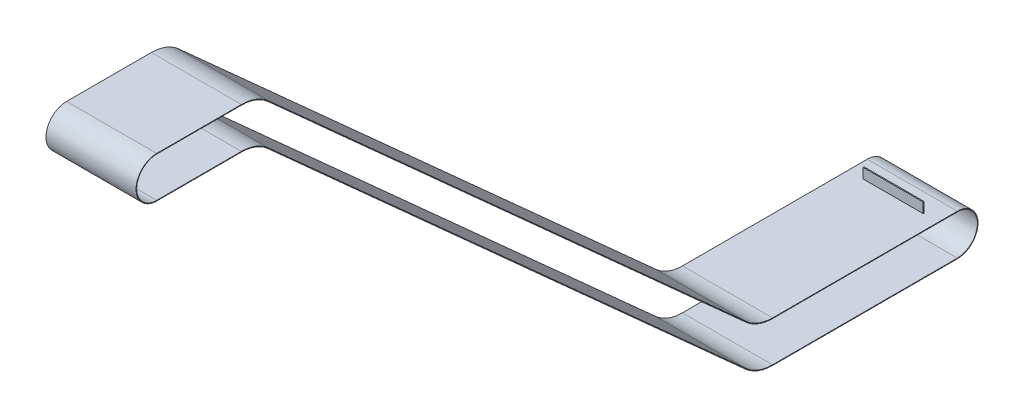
ISO-10303-21;
HEADER;
FILE_DESCRIPTION(('STEP AP214'),'2;1');
FILE_NAME('part.step','',(''),(''),'','','');
FILE_SCHEMA(('AUTOMOTIVE_DESIGN { 1 0 10303 214 1 1 1 1 }'));
ENDSEC;
DATA;
#1=APPLICATION_CONTEXT('core data for automotive mechanical design processes');
#2=APPLICATION_PROTOCOL_DEFINITION('international standard','automotive_design',2000,#1);
#3=PRODUCT_CONTEXT('',#1,'mechanical');
#4=PRODUCT('Part','Part','',(#3));
#5=PRODUCT_RELATED_PRODUCT_CATEGORY('part','',(#4));
#6=PRODUCT_DEFINITION_FORMATION('','',#4);
#7=PRODUCT_DEFINITION_CONTEXT('part definition',#1,'design');
#8=PRODUCT_DEFINITION('design','',#6,#7);
#9=PRODUCT_DEFINITION_SHAPE('','',#8);
#10=(LENGTH_UNIT() NAMED_UNIT(*) SI_UNIT(.MILLI.,.METRE.));
#11=(NAMED_UNIT(*) PLANE_ANGLE_UNIT() SI_UNIT($,.RADIAN.));
#12=(NAMED_UNIT(*) SI_UNIT($,.STERADIAN.) SOLID_ANGLE_UNIT());
#13=UNCERTAINTY_MEASURE_WITH_UNIT(LENGTH_MEASURE(1.E-05),#10,'distance_accuracy_value','');
#14=(GEOMETRIC_REPRESENTATION_CONTEXT(3) GLOBAL_UNCERTAINTY_ASSIGNED_CONTEXT((#13)) GLOBAL_UNIT_ASSIGNED_CONTEXT((#10,
#11,#12)) REPRESENTATION_CONTEXT('',''));
#15=CARTESIAN_POINT('',(0.,0.,0.));
#16=DIRECTION('',(0.,0.,1.));
#17=DIRECTION('',(1.,0.,0.));
#18=AXIS2_PLACEMENT_3D('',#15,#16,#17);
#19=CARTESIAN_POINT('',(450.,-2244.,-4000.));
#20=DIRECTION('',(0.,-1.,0.));
#21=DIRECTION('',(0.,0.,-1.));
#22=AXIS2_PLACEMENT_3D('',#19,#20,#21);
#23=PLANE('',#22);
#24=DIRECTION('',(0.,0.,1.));
#25=VECTOR('',#24,1.);
#26=CARTESIAN_POINT('',(-450.,-2244.,-4000.));
#27=LINE('',#26,#25);
#28=CARTESIAN_POINT('',(-450.,-2244.,-4000.));
#29=VERTEX_POINT('',#28);
#30=CARTESIAN_POINT('',(-450.,-2244.,-2153.49440209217));
#31=VERTEX_POINT('',#30);
#32=EDGE_CURVE('E511',#29,#31,#27,.T.);
#33=ORIENTED_EDGE('',*,*,#32,.T.);
#34=DIRECTION('',(-1.,0.,0.));
#35=VECTOR('',#34,1.);
#36=CARTESIAN_POINT('',(450.,-2244.,-2153.49440209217));
#37=LINE('',#36,#35);
#38=CARTESIAN_POINT('',(450.,-2244.,-2153.49440209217));
#39=VERTEX_POINT('',#38);
#40=EDGE_CURVE('E540',#39,#31,#37,.T.);
#41=ORIENTED_EDGE('',*,*,#40,.F.);
#42=DIRECTION('',(0.,0.,1.));
#43=VECTOR('',#42,1.);
#44=CARTESIAN_POINT('',(450.,-2244.,-4000.));
#45=LINE('',#44,#43);
#46=CARTESIAN_POINT('',(450.,-2244.,-4000.));
#47=VERTEX_POINT('',#46);
#48=EDGE_CURVE('E474',#47,#39,#45,.T.);
#49=ORIENTED_EDGE('',*,*,#48,.F.);
#50=DIRECTION('',(-1.,0.,0.));
#51=VECTOR('',#50,1.);
#52=CARTESIAN_POINT('',(450.,-2244.,-4000.));
#53=LINE('',#52,#51);
#54=EDGE_CURVE('E544',#47,#29,#53,.T.);
#55=ORIENTED_EDGE('',*,*,#54,.T.);
#56=EDGE_LOOP('',(#33,#41,#49,#55));
#57=FACE_BOUND('',#56,.T.);
#58=DIRECTION('',(0.,0.,-1.));
#59=VECTOR('',#58,1.);
#60=CARTESIAN_POINT('',(300.,-2244.,-3818.00458239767));
#61=LINE('',#60,#59);
#62=CARTESIAN_POINT('',(300.,-2244.,-3808.00458239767));
#63=VERTEX_POINT('',#62);
#64=CARTESIAN_POINT('',(300.,-2244.,-3818.00458239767));
#65=VERTEX_POINT('',#64);
#66=EDGE_CURVE('E319',#63,#65,#61,.T.);
#67=ORIENTED_EDGE('',*,*,#66,.F.);
#68=DIRECTION('',(1.,0.,0.));
#69=VECTOR('',#68,1.);
#70=CARTESIAN_POINT('',(-300.,-2244.,-3808.00458239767));
#71=LINE('',#70,#69);
#72=CARTESIAN_POINT('',(-300.,-2244.,-3808.00458239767));
#73=VERTEX_POINT('',#72);
#74=EDGE_CURVE('E316',#73,#63,#71,.T.);
#75=ORIENTED_EDGE('',*,*,#74,.F.);
#76=DIRECTION('',(0.,0.,1.));
#77=VECTOR('',#76,1.);
#78=CARTESIAN_POINT('',(-300.,-2244.,-3818.00458239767));
#79=LINE('',#78,#77);
#80=CARTESIAN_POINT('',(-300.,-2244.,-3818.00458239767));
#81=VERTEX_POINT('',#80);
#82=EDGE_CURVE('E132',#81,#73,#79,.T.);
#83=ORIENTED_EDGE('',*,*,#82,.F.);
#84=DIRECTION('',(-1.,0.,0.));
#85=VECTOR('',#84,1.);
#86=CARTESIAN_POINT('',(-300.,-2244.,-3818.00458239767));
#87=LINE('',#86,#85);
#88=EDGE_CURVE('E127',#65,#81,#87,.T.);
#89=ORIENTED_EDGE('',*,*,#88,.F.);
#90=EDGE_LOOP('',(#67,#75,#83,#89));
#91=FACE_BOUND('',#90,.T.);
#92=ADVANCED_FACE('F111',(#57,#91),#23,.F.);
#93=CARTESIAN_POINT('',(450.,2050.,4000.));
#94=DIRECTION('',(1.,0.,0.));
#95=DIRECTION('',(0.,0.,-1.));
#96=AXIS2_PLACEMENT_3D('',#93,#94,#95);
#97=PLANE('',#96);
#98=CARTESIAN_POINT('',(450.,2050.,4000.));
#99=DIRECTION('',(1.,0.,0.));
#100=DIRECTION('',(0.,0.,-1.));
#101=AXIS2_PLACEMENT_3D('',#98,#99,#100);
#102=CIRCLE('',#101,206.);
#103=CARTESIAN_POINT('',(450.,2256.,4000.));
#104=VERTEX_POINT('',#103);
#105=CARTESIAN_POINT('',(450.,1844.,4000.));
#106=VERTEX_POINT('',#105);
#107=EDGE_CURVE('E451',#104,#106,#102,.T.);
#108=ORIENTED_EDGE('',*,*,#107,.T.);
#109=DIRECTION('',(0.,0.,-1.));
#110=VECTOR('',#109,1.);
#111=CARTESIAN_POINT('',(450.,1844.,4000.));
#112=LINE('',#111,#110);
#113=CARTESIAN_POINT('',(450.,1844.,3153.49440209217));
#114=VERTEX_POINT('',#113);
#115=EDGE_CURVE('E455',#106,#114,#112,.T.);
#116=ORIENTED_EDGE('',*,*,#115,.T.);
#117=CARTESIAN_POINT('',(450.,1450.,3153.49440209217));
#118=DIRECTION('',(1.,0.,0.));
#119=DIRECTION('',(0.,0.,-1.));
#120=AXIS2_PLACEMENT_3D('',#117,#118,#119);
#121=CIRCLE('',#120,394.);
#122=CARTESIAN_POINT('',(450.,1742.85789362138,2889.92229783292));
#123=VERTEX_POINT('',#122);
#124=EDGE_CURVE('E459',#114,#123,#121,.F.);
#125=ORIENTED_EDGE('',*,*,#124,.T.);
#126=DIRECTION('',(0.,-0.66896473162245,-0.743294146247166));
#127=VECTOR('',#126,1.);
#128=CARTESIAN_POINT('',(450.,-2551.77742337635,-1881.89472105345));
#129=LINE('',#128,#127);
#130=CARTESIAN_POINT('',(450.,-2551.77742337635,-1881.89472105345));
#131=VERTEX_POINT('',#130);
#132=EDGE_CURVE('E462',#123,#131,#129,.T.);
#133=ORIENTED_EDGE('',*,*,#132,.T.);
#134=CARTESIAN_POINT('',(450.,-2250.,-2153.49440209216));
#135=DIRECTION('',(1.,0.,0.));
#136=DIRECTION('',(0.,0.,-1.));
#137=AXIS2_PLACEMENT_3D('',#134,#135,#136);
#138=CIRCLE('',#137,406.);
#139=CARTESIAN_POINT('',(450.,-2656.,-2153.49440209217));
#140=VERTEX_POINT('',#139);
#141=EDGE_CURVE('E465',#131,#140,#138,.T.);
#142=ORIENTED_EDGE('',*,*,#141,.T.);
#143=DIRECTION('',(0.,0.,-1.));
#144=VECTOR('',#143,1.);
#145=CARTESIAN_POINT('',(450.,-2656.,-4000.));
#146=LINE('',#145,#144);
#147=CARTESIAN_POINT('',(450.,-2656.,-4000.));
#148=VERTEX_POINT('',#147);
#149=EDGE_CURVE('E468',#140,#148,#146,.T.);
#150=ORIENTED_EDGE('',*,*,#149,.T.);
#151=CARTESIAN_POINT('',(450.,-2450.,-4000.));
#152=DIRECTION('',(1.,0.,0.));
#153=DIRECTION('',(0.,0.,-1.));
#154=AXIS2_PLACEMENT_3D('',#151,#152,#153);
#155=CIRCLE('',#154,206.);
#156=EDGE_CURVE('E471',#148,#47,#155,.T.);
#157=ORIENTED_EDGE('',*,*,#156,.T.);
#158=ORIENTED_EDGE('',*,*,#48,.T.);
#159=CARTESIAN_POINT('',(450.,-1850.,-2153.49440209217));
#160=DIRECTION('',(1.,0.,0.));
#161=DIRECTION('',(0.,0.,-1.));
#162=AXIS2_PLACEMENT_3D('',#159,#160,#161);
#163=CIRCLE('',#162,394.);
#164=CARTESIAN_POINT('',(450.,-2142.85789362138,-1889.92229783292));
#165=VERTEX_POINT('',#164);
#166=EDGE_CURVE('E477',#39,#165,#163,.F.);
#167=ORIENTED_EDGE('',*,*,#166,.T.);
#168=DIRECTION('',(0.,0.66896473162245,0.743294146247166));
#169=VECTOR('',#168,1.);
#170=CARTESIAN_POINT('',(450.,2151.77742337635,2881.89472105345));
#171=LINE('',#170,#169);
#172=CARTESIAN_POINT('',(450.,2151.77742337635,2881.89472105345));
#173=VERTEX_POINT('',#172);
#174=EDGE_CURVE('E480',#165,#173,#171,.T.);
#175=ORIENTED_EDGE('',*,*,#174,.T.);
#176=CARTESIAN_POINT('',(450.,1850.,3153.49440209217));
#177=DIRECTION('',(1.,0.,0.));
#178=DIRECTION('',(0.,0.,-1.));
#179=AXIS2_PLACEMENT_3D('',#176,#177,#178);
#180=CIRCLE('',#179,406.);
#181=CARTESIAN_POINT('',(450.,2256.,3153.49440209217));
#182=VERTEX_POINT('',#181);
#183=EDGE_CURVE('E483',#173,#182,#180,.T.);
#184=ORIENTED_EDGE('',*,*,#183,.T.);
#185=DIRECTION('',(0.,0.,1.));
#186=VECTOR('',#185,1.);
#187=CARTESIAN_POINT('',(450.,2256.,3153.49440209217));
#188=LINE('',#187,#186);
#189=EDGE_CURVE('E486',#182,#104,#188,.T.);
#190=ORIENTED_EDGE('',*,*,#189,.T.);
#191=EDGE_LOOP('',(#108,#116,#125,#133,#142,#150,#157,#158,#167,#175,#184,#190));
#192=FACE_BOUND('',#191,.T.);
#193=DIRECTION('',(0.,0.,-1.));
#194=VECTOR('',#193,1.);
#195=CARTESIAN_POINT('',(450.,1850.,4000.));
#196=LINE('',#195,#194);
#197=CARTESIAN_POINT('',(450.,1850.,4000.));
#198=VERTEX_POINT('',#197);
#199=CARTESIAN_POINT('',(450.,1850.,3153.49440209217));
#200=VERTEX_POINT('',#199);
#201=EDGE_CURVE('E335',#198,#200,#196,.T.);
#202=ORIENTED_EDGE('',*,*,#201,.F.);
#203=CARTESIAN_POINT('',(450.,2050.,4000.));
#204=DIRECTION('',(1.,0.,0.));
#205=DIRECTION('',(0.,0.,-1.));
#206=AXIS2_PLACEMENT_3D('',#203,#204,#205);
#207=CIRCLE('',#206,200.);
#208=CARTESIAN_POINT('',(450.,2250.,4000.));
#209=VERTEX_POINT('',#208);
#210=EDGE_CURVE('E332',#209,#198,#207,.T.);
#211=ORIENTED_EDGE('',*,*,#210,.F.);
#212=DIRECTION('',(0.,0.,1.));
#213=VECTOR('',#212,1.);
#214=CARTESIAN_POINT('',(450.,2250.,3153.49440209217));
#215=LINE('',#214,#213);
#216=CARTESIAN_POINT('',(450.,2250.,3153.49440209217));
#217=VERTEX_POINT('',#216);
#218=EDGE_CURVE('E367',#217,#209,#215,.T.);
#219=ORIENTED_EDGE('',*,*,#218,.F.);
#220=CARTESIAN_POINT('',(450.,1850.,3153.49440209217));
#221=DIRECTION('',(1.,0.,0.));
#222=DIRECTION('',(0.,0.,-1.));
#223=AXIS2_PLACEMENT_3D('',#220,#221,#222);
#224=CIRCLE('',#223,400.);
#225=CARTESIAN_POINT('',(450.,2147.31765849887,2885.90850944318));
#226=VERTEX_POINT('',#225);
#227=EDGE_CURVE('E363',#226,#217,#224,.T.);
#228=ORIENTED_EDGE('',*,*,#227,.F.);
#229=DIRECTION('',(0.,0.66896473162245,0.743294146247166));
#230=VECTOR('',#229,1.);
#231=CARTESIAN_POINT('',(450.,2147.31765849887,2885.90850944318));
#232=LINE('',#231,#230);
#233=CARTESIAN_POINT('',(450.,-2147.31765849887,-1885.90850944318));
#234=VERTEX_POINT('',#233);
#235=EDGE_CURVE('E360',#234,#226,#232,.T.);
#236=ORIENTED_EDGE('',*,*,#235,.F.);
#237=CARTESIAN_POINT('',(450.,-1850.,-2153.49440209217));
#238=DIRECTION('',(-1.,0.,0.));
#239=DIRECTION('',(0.,0.,-1.));
#240=AXIS2_PLACEMENT_3D('',#237,#238,#239);
#241=CIRCLE('',#240,400.);
#242=CARTESIAN_POINT('',(450.,-2250.,-2153.49440209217));
#243=VERTEX_POINT('',#242);
#244=EDGE_CURVE('E357',#243,#234,#241,.T.);
#245=ORIENTED_EDGE('',*,*,#244,.F.);
#246=DIRECTION('',(0.,0.,1.));
#247=VECTOR('',#246,1.);
#248=CARTESIAN_POINT('',(450.,-2250.,-4000.));
#249=LINE('',#248,#247);
#250=CARTESIAN_POINT('',(450.,-2250.,-4000.));
#251=VERTEX_POINT('',#250);
#252=EDGE_CURVE('E354',#251,#243,#249,.T.);
#253=ORIENTED_EDGE('',*,*,#252,.F.);
#254=CARTESIAN_POINT('',(450.,-2450.,-4000.));
#255=DIRECTION('',(1.,0.,0.));
#256=DIRECTION('',(0.,0.,-1.));
#257=AXIS2_PLACEMENT_3D('',#254,#255,#256);
#258=CIRCLE('',#257,200.);
#259=CARTESIAN_POINT('',(450.,-2650.,-4000.));
#260=VERTEX_POINT('',#259);
#261=EDGE_CURVE('E351',#260,#251,#258,.T.);
#262=ORIENTED_EDGE('',*,*,#261,.F.);
#263=DIRECTION('',(0.,0.,-1.));
#264=VECTOR('',#263,1.);
#265=CARTESIAN_POINT('',(450.,-2650.,-4000.));
#266=LINE('',#265,#264);
#267=CARTESIAN_POINT('',(450.,-2650.,-2153.49440209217));
#268=VERTEX_POINT('',#267);
#269=EDGE_CURVE('E348',#268,#260,#266,.T.);
#270=ORIENTED_EDGE('',*,*,#269,.F.);
#271=CARTESIAN_POINT('',(450.,-2250.,-2153.49440209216));
#272=DIRECTION('',(1.,0.,0.));
#273=DIRECTION('',(0.,0.,-1.));
#274=AXIS2_PLACEMENT_3D('',#271,#272,#273);
#275=CIRCLE('',#274,400.);
#276=CARTESIAN_POINT('',(450.,-2547.31765849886,-1885.90850944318));
#277=VERTEX_POINT('',#276);
#278=EDGE_CURVE('E345',#277,#268,#275,.T.);
#279=ORIENTED_EDGE('',*,*,#278,.F.);
#280=DIRECTION('',(0.,-0.66896473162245,-0.743294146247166));
#281=VECTOR('',#280,1.);
#282=CARTESIAN_POINT('',(450.,-2547.31765849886,-1885.90850944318));
#283=LINE('',#282,#281);
#284=CARTESIAN_POINT('',(450.,1747.31765849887,2885.90850944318));
#285=VERTEX_POINT('',#284);
#286=EDGE_CURVE('E342',#285,#277,#283,.T.);
#287=ORIENTED_EDGE('',*,*,#286,.F.);
#288=CARTESIAN_POINT('',(450.,1450.,3153.49440209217));
#289=DIRECTION('',(-1.,0.,0.));
#290=DIRECTION('',(0.,0.,-1.));
#291=AXIS2_PLACEMENT_3D('',#288,#289,#290);
#292=CIRCLE('',#291,400.);
#293=EDGE_CURVE('E339',#200,#285,#292,.T.);
#294=ORIENTED_EDGE('',*,*,#293,.F.);
#295=EDGE_LOOP('',(#202,#211,#219,#228,#236,#245,#253,#262,#270,#279,#287,#294));
#296=FACE_BOUND('',#295,.T.);
#297=ADVANCED_FACE('F589',(#192,#296),#97,.T.);
#298=CARTESIAN_POINT('',(-450.,2050.,4000.));
#299=DIRECTION('',(1.,0.,0.));
#300=DIRECTION('',(0.,0.,-1.));
#301=AXIS2_PLACEMENT_3D('',#298,#299,#300);
#302=PLANE('',#301);
#303=CARTESIAN_POINT('',(-450.,2050.,4000.));
#304=DIRECTION('',(1.,0.,0.));
#305=DIRECTION('',(0.,0.,-1.));
#306=AXIS2_PLACEMENT_3D('',#303,#304,#305);
#307=CIRCLE('',#306,206.);
#308=CARTESIAN_POINT('',(-450.,2256.,4000.));
#309=VERTEX_POINT('',#308);
#310=CARTESIAN_POINT('',(-450.,1844.,4000.));
#311=VERTEX_POINT('',#310);
#312=EDGE_CURVE('E450',#309,#311,#307,.T.);
#313=ORIENTED_EDGE('',*,*,#312,.F.);
#314=DIRECTION('',(0.,0.,1.));
#315=VECTOR('',#314,1.);
#316=CARTESIAN_POINT('',(-450.,2256.,3153.49440209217));
#317=LINE('',#316,#315);
#318=CARTESIAN_POINT('',(-450.,2256.,3153.49440209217));
#319=VERTEX_POINT('',#318);
#320=EDGE_CURVE('E456',#319,#309,#317,.T.);
#321=ORIENTED_EDGE('',*,*,#320,.F.);
#322=CARTESIAN_POINT('',(-450.,1850.,3153.49440209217));
#323=DIRECTION('',(1.,0.,0.));
#324=DIRECTION('',(0.,0.,-1.));
#325=AXIS2_PLACEMENT_3D('',#322,#323,#324);
#326=CIRCLE('',#325,406.);
#327=CARTESIAN_POINT('',(-450.,2151.77742337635,2881.89472105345));
#328=VERTEX_POINT('',#327);
#329=EDGE_CURVE('E520',#328,#319,#326,.T.);
#330=ORIENTED_EDGE('',*,*,#329,.F.);
#331=DIRECTION('',(0.,0.66896473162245,0.743294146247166));
#332=VECTOR('',#331,1.);
#333=CARTESIAN_POINT('',(-450.,2151.77742337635,2881.89472105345));
#334=LINE('',#333,#332);
#335=CARTESIAN_POINT('',(-450.,-2142.85789362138,-1889.92229783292));
#336=VERTEX_POINT('',#335);
#337=EDGE_CURVE('E517',#336,#328,#334,.T.);
#338=ORIENTED_EDGE('',*,*,#337,.F.);
#339=CARTESIAN_POINT('',(-450.,-1850.,-2153.49440209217));
#340=DIRECTION('',(1.,0.,0.));
#341=DIRECTION('',(0.,0.,-1.));
#342=AXIS2_PLACEMENT_3D('',#339,#340,#341);
#343=CIRCLE('',#342,394.);
#344=EDGE_CURVE('E514',#31,#336,#343,.F.);
#345=ORIENTED_EDGE('',*,*,#344,.F.);
#346=ORIENTED_EDGE('',*,*,#32,.F.);
#347=CARTESIAN_POINT('',(-450.,-2450.,-4000.));
#348=DIRECTION('',(1.,0.,0.));
#349=DIRECTION('',(0.,0.,-1.));
#350=AXIS2_PLACEMENT_3D('',#347,#348,#349);
#351=CIRCLE('',#350,206.);
#352=CARTESIAN_POINT('',(-450.,-2656.,-4000.));
#353=VERTEX_POINT('',#352);
#354=EDGE_CURVE('E508',#353,#29,#351,.T.);
#355=ORIENTED_EDGE('',*,*,#354,.F.);
#356=DIRECTION('',(0.,0.,-1.));
#357=VECTOR('',#356,1.);
#358=CARTESIAN_POINT('',(-450.,-2656.,-4000.));
#359=LINE('',#358,#357);
#360=CARTESIAN_POINT('',(-450.,-2656.,-2153.49440209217));
#361=VERTEX_POINT('',#360);
#362=EDGE_CURVE('E505',#361,#353,#359,.T.);
#363=ORIENTED_EDGE('',*,*,#362,.F.);
#364=CARTESIAN_POINT('',(-450.,-2250.,-2153.49440209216));
#365=DIRECTION('',(1.,0.,0.));
#366=DIRECTION('',(0.,0.,-1.));
#367=AXIS2_PLACEMENT_3D('',#364,#365,#366);
#368=CIRCLE('',#367,406.);
#369=CARTESIAN_POINT('',(-450.,-2551.77742337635,-1881.89472105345));
#370=VERTEX_POINT('',#369);
#371=EDGE_CURVE('E502',#370,#361,#368,.T.);
#372=ORIENTED_EDGE('',*,*,#371,.F.);
#373=DIRECTION('',(0.,-0.66896473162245,-0.743294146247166));
#374=VECTOR('',#373,1.);
#375=CARTESIAN_POINT('',(-450.,-2551.77742337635,-1881.89472105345));
#376=LINE('',#375,#374);
#377=CARTESIAN_POINT('',(-450.,1742.85789362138,2889.92229783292));
#378=VERTEX_POINT('',#377);
#379=EDGE_CURVE('E499',#378,#370,#376,.T.);
#380=ORIENTED_EDGE('',*,*,#379,.F.);
#381=CARTESIAN_POINT('',(-450.,1450.,3153.49440209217));
#382=DIRECTION('',(1.,0.,0.));
#383=DIRECTION('',(0.,0.,-1.));
#384=AXIS2_PLACEMENT_3D('',#381,#382,#383);
#385=CIRCLE('',#384,394.);
#386=CARTESIAN_POINT('',(-450.,1844.,3153.49440209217));
#387=VERTEX_POINT('',#386);
#388=EDGE_CURVE('E496',#387,#378,#385,.F.);
#389=ORIENTED_EDGE('',*,*,#388,.F.);
#390=DIRECTION('',(0.,0.,-1.));
#391=VECTOR('',#390,1.);
#392=CARTESIAN_POINT('',(-450.,1844.,4000.));
#393=LINE('',#392,#391);
#394=EDGE_CURVE('E493',#311,#387,#393,.T.);
#395=ORIENTED_EDGE('',*,*,#394,.F.);
#396=EDGE_LOOP('',(#313,#321,#330,#338,#345,#346,#355,#363,#372,#380,#389,#395));
#397=FACE_BOUND('',#396,.T.);
#398=CARTESIAN_POINT('',(-450.,2050.,4000.));
#399=DIRECTION('',(1.,0.,0.));
#400=DIRECTION('',(0.,0.,-1.));
#401=AXIS2_PLACEMENT_3D('',#398,#399,#400);
#402=CIRCLE('',#401,200.);
#403=CARTESIAN_POINT('',(-450.,2250.,4000.));
#404=VERTEX_POINT('',#403);
#405=CARTESIAN_POINT('',(-450.,1850.,4000.));
#406=VERTEX_POINT('',#405);
#407=EDGE_CURVE('E321',#404,#406,#402,.T.);
#408=ORIENTED_EDGE('',*,*,#407,.T.);
#409=DIRECTION('',(0.,0.,-1.));
#410=VECTOR('',#409,1.);
#411=CARTESIAN_POINT('',(-450.,1850.,4000.));
#412=LINE('',#411,#410);
#413=CARTESIAN_POINT('',(-450.,1850.,3153.49440209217));
#414=VERTEX_POINT('',#413);
#415=EDGE_CURVE('E326',#406,#414,#412,.T.);
#416=ORIENTED_EDGE('',*,*,#415,.T.);
#417=CARTESIAN_POINT('',(-450.,1450.,3153.49440209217));
#418=DIRECTION('',(-1.,0.,0.));
#419=DIRECTION('',(0.,0.,-1.));
#420=AXIS2_PLACEMENT_3D('',#417,#418,#419);
#421=CIRCLE('',#420,400.);
#422=CARTESIAN_POINT('',(-450.,1747.31765849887,2885.90850944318));
#423=VERTEX_POINT('',#422);
#424=EDGE_CURVE('E374',#414,#423,#421,.T.);
#425=ORIENTED_EDGE('',*,*,#424,.T.);
#426=DIRECTION('',(0.,-0.66896473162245,-0.743294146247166));
#427=VECTOR('',#426,1.);
#428=CARTESIAN_POINT('',(-450.,-2547.31765849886,-1885.90850944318));
#429=LINE('',#428,#427);
#430=CARTESIAN_POINT('',(-450.,-2547.31765849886,-1885.90850944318));
#431=VERTEX_POINT('',#430);
#432=EDGE_CURVE('E378',#423,#431,#429,.T.);
#433=ORIENTED_EDGE('',*,*,#432,.T.);
#434=CARTESIAN_POINT('',(-450.,-2250.,-2153.49440209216));
#435=DIRECTION('',(1.,0.,0.));
#436=DIRECTION('',(0.,0.,-1.));
#437=AXIS2_PLACEMENT_3D('',#434,#435,#436);
#438=CIRCLE('',#437,400.);
#439=CARTESIAN_POINT('',(-450.,-2650.,-2153.49440209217));
#440=VERTEX_POINT('',#439);
#441=EDGE_CURVE('E382',#431,#440,#438,.T.);
#442=ORIENTED_EDGE('',*,*,#441,.T.);
#443=DIRECTION('',(0.,0.,-1.));
#444=VECTOR('',#443,1.);
#445=CARTESIAN_POINT('',(-450.,-2650.,-4000.));
#446=LINE('',#445,#444);
#447=CARTESIAN_POINT('',(-450.,-2650.,-4000.));
#448=VERTEX_POINT('',#447);
#449=EDGE_CURVE('E386',#440,#448,#446,.T.);
#450=ORIENTED_EDGE('',*,*,#449,.T.);
#451=CARTESIAN_POINT('',(-450.,-2450.,-4000.));
#452=DIRECTION('',(1.,0.,0.));
#453=DIRECTION('',(0.,0.,-1.));
#454=AXIS2_PLACEMENT_3D('',#451,#452,#453);
#455=CIRCLE('',#454,200.);
#456=CARTESIAN_POINT('',(-450.,-2250.,-4000.));
#457=VERTEX_POINT('',#456);
#458=EDGE_CURVE('E390',#448,#457,#455,.T.);
#459=ORIENTED_EDGE('',*,*,#458,.T.);
#460=DIRECTION('',(0.,0.,1.));
#461=VECTOR('',#460,1.);
#462=CARTESIAN_POINT('',(-450.,-2250.,-4000.));
#463=LINE('',#462,#461);
#464=CARTESIAN_POINT('',(-450.,-2250.,-2153.49440209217));
#465=VERTEX_POINT('',#464);
#466=EDGE_CURVE('E394',#457,#465,#463,.T.);
#467=ORIENTED_EDGE('',*,*,#466,.T.);
#468=CARTESIAN_POINT('',(-450.,-1850.,-2153.49440209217));
#469=DIRECTION('',(-1.,0.,0.));
#470=DIRECTION('',(0.,0.,-1.));
#471=AXIS2_PLACEMENT_3D('',#468,#469,#470);
#472=CIRCLE('',#471,400.);
#473=CARTESIAN_POINT('',(-450.,-2147.31765849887,-1885.90850944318));
#474=VERTEX_POINT('',#473);
#475=EDGE_CURVE('E398',#465,#474,#472,.T.);
#476=ORIENTED_EDGE('',*,*,#475,.T.);
#477=DIRECTION('',(0.,0.66896473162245,0.743294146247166));
#478=VECTOR('',#477,1.);
#479=CARTESIAN_POINT('',(-450.,2147.31765849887,2885.90850944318));
#480=LINE('',#479,#478);
#481=CARTESIAN_POINT('',(-450.,2147.31765849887,2885.90850944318));
#482=VERTEX_POINT('',#481);
#483=EDGE_CURVE('E402',#474,#482,#480,.T.);
#484=ORIENTED_EDGE('',*,*,#483,.T.);
#485=CARTESIAN_POINT('',(-450.,1850.,3153.49440209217));
#486=DIRECTION('',(1.,0.,0.));
#487=DIRECTION('',(0.,0.,-1.));
#488=AXIS2_PLACEMENT_3D('',#485,#486,#487);
#489=CIRCLE('',#488,400.);
#490=CARTESIAN_POINT('',(-450.,2250.,3153.49440209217));
#491=VERTEX_POINT('',#490);
#492=EDGE_CURVE('E406',#482,#491,#489,.T.);
#493=ORIENTED_EDGE('',*,*,#492,.T.);
#494=DIRECTION('',(0.,0.,1.));
#495=VECTOR('',#494,1.);
#496=CARTESIAN_POINT('',(-450.,2250.,3153.49440209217));
#497=LINE('',#496,#495);
#498=EDGE_CURVE('E336',#491,#404,#497,.T.);
#499=ORIENTED_EDGE('',*,*,#498,.T.);
#500=EDGE_LOOP('',(#408,#416,#425,#433,#442,#450,#459,#467,#476,#484,#493,#499));
#501=FACE_BOUND('',#500,.T.);
#502=ADVANCED_FACE('F575',(#397,#501),#302,.F.);
#503=CARTESIAN_POINT('',(450.,2050.,4000.));
#504=DIRECTION('',(-1.,0.,0.));
#505=DIRECTION('',(0.,0.,1.));
#506=AXIS2_PLACEMENT_3D('',#503,#504,#505);
#507=CYLINDRICAL_SURFACE('',#506,206.);
#508=ORIENTED_EDGE('',*,*,#312,.T.);
#509=DIRECTION('',(-1.,0.,0.));
#510=VECTOR('',#509,1.);
#511=CARTESIAN_POINT('',(450.,1844.,4000.));
#512=LINE('',#511,#510);
#513=EDGE_CURVE('E12',#106,#311,#512,.T.);
#514=ORIENTED_EDGE('',*,*,#513,.F.);
#515=ORIENTED_EDGE('',*,*,#107,.F.);
#516=DIRECTION('',(-1.,0.,0.));
#517=VECTOR('',#516,1.);
#518=CARTESIAN_POINT('',(450.,2256.,4000.));
#519=LINE('',#518,#517);
#520=EDGE_CURVE('E489',#104,#309,#519,.T.);
#521=ORIENTED_EDGE('',*,*,#520,.T.);
#522=EDGE_LOOP('',(#508,#514,#515,#521));
#523=FACE_BOUND('',#522,.T.);
#524=ADVANCED_FACE('F113',(#523),#507,.T.);
#525=CARTESIAN_POINT('',(450.,1844.,4000.));
#526=DIRECTION('',(0.,1.,0.));
#527=DIRECTION('',(0.,0.,1.));
#528=AXIS2_PLACEMENT_3D('',#525,#526,#527);
#529=PLANE('',#528);
#530=ORIENTED_EDGE('',*,*,#394,.T.);
#531=DIRECTION('',(-1.,0.,0.));
#532=VECTOR('',#531,1.);
#533=CARTESIAN_POINT('',(450.,1844.,3153.49440209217));
#534=LINE('',#533,#532);
#535=EDGE_CURVE('E120',#114,#387,#534,.T.);
#536=ORIENTED_EDGE('',*,*,#535,.F.);
#537=ORIENTED_EDGE('',*,*,#115,.F.);
#538=ORIENTED_EDGE('',*,*,#513,.T.);
#539=EDGE_LOOP('',(#530,#536,#537,#538));
#540=FACE_BOUND('',#539,.T.);
#541=ADVANCED_FACE('F594',(#540),#529,.F.);
#542=CARTESIAN_POINT('',(450.,1450.,3153.49440209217));
#543=DIRECTION('',(-1.,0.,0.));
#544=DIRECTION('',(0.,0.,1.));
#545=AXIS2_PLACEMENT_3D('',#542,#543,#544);
#546=CYLINDRICAL_SURFACE('',#545,394.);
#547=ORIENTED_EDGE('',*,*,#388,.T.);
#548=DIRECTION('',(-1.,0.,0.));
#549=VECTOR('',#548,1.);
#550=CARTESIAN_POINT('',(450.,1742.85789362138,2889.92229783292));
#551=LINE('',#550,#549);
#552=EDGE_CURVE('E560',#123,#378,#551,.T.);
#553=ORIENTED_EDGE('',*,*,#552,.F.);
#554=ORIENTED_EDGE('',*,*,#124,.F.);
#555=ORIENTED_EDGE('',*,*,#535,.T.);
#556=EDGE_LOOP('',(#547,#553,#554,#555));
#557=FACE_BOUND('',#556,.T.);
#558=ADVANCED_FACE('F569',(#557),#546,.F.);
#559=CARTESIAN_POINT('',(450.,-2551.77742337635,-1881.89472105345));
#560=DIRECTION('',(0.,0.743294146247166,-0.66896473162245));
#561=DIRECTION('',(0.,0.66896473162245,0.743294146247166));
#562=AXIS2_PLACEMENT_3D('',#559,#560,#561);
#563=PLANE('',#562);
#564=ORIENTED_EDGE('',*,*,#379,.T.);
#565=DIRECTION('',(-1.,0.,0.));
#566=VECTOR('',#565,1.);
#567=CARTESIAN_POINT('',(450.,-2551.77742337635,-1881.89472105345));
#568=LINE('',#567,#566);
#569=EDGE_CURVE('E556',#131,#370,#568,.T.);
#570=ORIENTED_EDGE('',*,*,#569,.F.);
#571=ORIENTED_EDGE('',*,*,#132,.F.);
#572=ORIENTED_EDGE('',*,*,#552,.T.);
#573=EDGE_LOOP('',(#564,#570,#571,#572));
#574=FACE_BOUND('',#573,.T.);
#575=ADVANCED_FACE('F581',(#574),#563,.F.);
#576=CARTESIAN_POINT('',(450.,-2250.,-2153.49440209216));
#577=DIRECTION('',(-1.,0.,0.));
#578=DIRECTION('',(0.,0.,1.));
#579=AXIS2_PLACEMENT_3D('',#576,#577,#578);
#580=CYLINDRICAL_SURFACE('',#579,406.);
#581=ORIENTED_EDGE('',*,*,#371,.T.);
#582=DIRECTION('',(-1.,0.,0.));
#583=VECTOR('',#582,1.);
#584=CARTESIAN_POINT('',(450.,-2656.,-2153.49440209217));
#585=LINE('',#584,#583);
#586=EDGE_CURVE('E552',#140,#361,#585,.T.);
#587=ORIENTED_EDGE('',*,*,#586,.F.);
#588=ORIENTED_EDGE('',*,*,#141,.F.);
#589=ORIENTED_EDGE('',*,*,#569,.T.);
#590=EDGE_LOOP('',(#581,#587,#588,#589));
#591=FACE_BOUND('',#590,.T.);
#592=ADVANCED_FACE('F585',(#591),#580,.T.);
#593=CARTESIAN_POINT('',(450.,-2656.,-4000.));
#594=DIRECTION('',(0.,1.,0.));
#595=DIRECTION('',(0.,0.,1.));
#596=AXIS2_PLACEMENT_3D('',#593,#594,#595);
#597=PLANE('',#596);
#598=ORIENTED_EDGE('',*,*,#362,.T.);
#599=DIRECTION('',(-1.,0.,0.));
#600=VECTOR('',#599,1.);
#601=CARTESIAN_POINT('',(450.,-2656.,-4000.));
#602=LINE('',#601,#600);
#603=EDGE_CURVE('E548',#148,#353,#602,.T.);
#604=ORIENTED_EDGE('',*,*,#603,.F.);
#605=ORIENTED_EDGE('',*,*,#149,.F.);
#606=ORIENTED_EDGE('',*,*,#586,.T.);
#607=EDGE_LOOP('',(#598,#604,#605,#606));
#608=FACE_BOUND('',#607,.T.);
#609=ADVANCED_FACE('F626',(#608),#597,.F.);
#610=CARTESIAN_POINT('',(450.,-2450.,-4000.));
#611=DIRECTION('',(-1.,0.,0.));
#612=DIRECTION('',(0.,0.,1.));
#613=AXIS2_PLACEMENT_3D('',#610,#611,#612);
#614=CYLINDRICAL_SURFACE('',#613,206.);
#615=ORIENTED_EDGE('',*,*,#354,.T.);
#616=ORIENTED_EDGE('',*,*,#54,.F.);
#617=ORIENTED_EDGE('',*,*,#156,.F.);
#618=ORIENTED_EDGE('',*,*,#603,.T.);
#619=EDGE_LOOP('',(#615,#616,#617,#618));
#620=FACE_BOUND('',#619,.T.);
#621=ADVANCED_FACE('F624',(#620),#614,.T.);
#622=CARTESIAN_POINT('',(450.,-1850.,-2153.49440209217));
#623=DIRECTION('',(-1.,0.,0.));
#624=DIRECTION('',(0.,0.,1.));
#625=AXIS2_PLACEMENT_3D('',#622,#623,#624);
#626=CYLINDRICAL_SURFACE('',#625,394.);
#627=ORIENTED_EDGE('',*,*,#344,.T.);
#628=DIRECTION('',(-1.,0.,0.));
#629=VECTOR('',#628,1.);
#630=CARTESIAN_POINT('',(450.,-2142.85789362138,-1889.92229783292));
#631=LINE('',#630,#629);
#632=EDGE_CURVE('E536',#165,#336,#631,.T.);
#633=ORIENTED_EDGE('',*,*,#632,.F.);
#634=ORIENTED_EDGE('',*,*,#166,.F.);
#635=ORIENTED_EDGE('',*,*,#40,.T.);
#636=EDGE_LOOP('',(#627,#633,#634,#635));
#637=FACE_BOUND('',#636,.T.);
#638=ADVANCED_FACE('F616',(#637),#626,.F.);
#639=CARTESIAN_POINT('',(450.,2151.77742337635,2881.89472105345));
#640=DIRECTION('',(0.,-0.743294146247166,0.66896473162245));
#641=DIRECTION('',(0.,-0.66896473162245,-0.743294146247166));
#642=AXIS2_PLACEMENT_3D('',#639,#640,#641);
#643=PLANE('',#642);
#644=ORIENTED_EDGE('',*,*,#337,.T.);
#645=DIRECTION('',(-1.,0.,0.));
#646=VECTOR('',#645,1.);
#647=CARTESIAN_POINT('',(450.,2151.77742337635,2881.89472105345));
#648=LINE('',#647,#646);
#649=EDGE_CURVE('E532',#173,#328,#648,.T.);
#650=ORIENTED_EDGE('',*,*,#649,.F.);
#651=ORIENTED_EDGE('',*,*,#174,.F.);
#652=ORIENTED_EDGE('',*,*,#632,.T.);
#653=EDGE_LOOP('',(#644,#650,#651,#652));
#654=FACE_BOUND('',#653,.T.);
#655=ADVANCED_FACE('F610',(#654),#643,.F.);
#656=CARTESIAN_POINT('',(450.,1850.,3153.49440209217));
#657=DIRECTION('',(-1.,0.,0.));
#658=DIRECTION('',(0.,0.,1.));
#659=AXIS2_PLACEMENT_3D('',#656,#657,#658);
#660=CYLINDRICAL_SURFACE('',#659,406.);
#661=ORIENTED_EDGE('',*,*,#329,.T.);
#662=DIRECTION('',(-1.,0.,0.));
#663=VECTOR('',#662,1.);
#664=CARTESIAN_POINT('',(450.,2256.,3153.49440209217));
#665=LINE('',#664,#663);
#666=EDGE_CURVE('E528',#182,#319,#665,.T.);
#667=ORIENTED_EDGE('',*,*,#666,.F.);
#668=ORIENTED_EDGE('',*,*,#183,.F.);
#669=ORIENTED_EDGE('',*,*,#649,.T.);
#670=EDGE_LOOP('',(#661,#667,#668,#669));
#671=FACE_BOUND('',#670,.T.);
#672=ADVANCED_FACE('F606',(#671),#660,.T.);
#673=CARTESIAN_POINT('',(450.,2256.,3153.49440209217));
#674=DIRECTION('',(0.,-1.,0.));
#675=DIRECTION('',(0.,0.,-1.));
#676=AXIS2_PLACEMENT_3D('',#673,#674,#675);
#677=PLANE('',#676);
#678=ORIENTED_EDGE('',*,*,#320,.T.);
#679=ORIENTED_EDGE('',*,*,#520,.F.);
#680=ORIENTED_EDGE('',*,*,#189,.F.);
#681=ORIENTED_EDGE('',*,*,#666,.T.);
#682=EDGE_LOOP('',(#678,#679,#680,#681));
#683=FACE_BOUND('',#682,.T.);
#684=ADVANCED_FACE('F601',(#683),#677,.F.);
#685=CARTESIAN_POINT('',(450.,2050.,4000.));
#686=DIRECTION('',(-1.,0.,0.));
#687=DIRECTION('',(0.,0.,1.));
#688=AXIS2_PLACEMENT_3D('',#685,#686,#687);
#689=CYLINDRICAL_SURFACE('',#688,200.);
#690=ORIENTED_EDGE('',*,*,#407,.F.);
#691=DIRECTION('',(-1.,0.,0.));
#692=VECTOR('',#691,1.);
#693=CARTESIAN_POINT('',(450.,2250.,4000.));
#694=LINE('',#693,#692);
#695=EDGE_CURVE('E369',#209,#404,#694,.T.);
#696=ORIENTED_EDGE('',*,*,#695,.F.);
#697=ORIENTED_EDGE('',*,*,#210,.T.);
#698=DIRECTION('',(-1.,0.,0.));
#699=VECTOR('',#698,1.);
#700=CARTESIAN_POINT('',(450.,1850.,4000.));
#701=LINE('',#700,#699);
#702=EDGE_CURVE('E446',#198,#406,#701,.T.);
#703=ORIENTED_EDGE('',*,*,#702,.T.);
#704=EDGE_LOOP('',(#690,#696,#697,#703));
#705=FACE_BOUND('',#704,.T.);
#706=ADVANCED_FACE('F650',(#705),#689,.F.);
#707=CARTESIAN_POINT('',(450.,1850.,4000.));
#708=DIRECTION('',(0.,1.,0.));
#709=DIRECTION('',(0.,0.,1.));
#710=AXIS2_PLACEMENT_3D('',#707,#708,#709);
#711=PLANE('',#710);
#712=ORIENTED_EDGE('',*,*,#415,.F.);
#713=ORIENTED_EDGE('',*,*,#702,.F.);
#714=ORIENTED_EDGE('',*,*,#201,.T.);
#715=DIRECTION('',(-1.,0.,0.));
#716=VECTOR('',#715,1.);
#717=CARTESIAN_POINT('',(450.,1850.,3153.49440209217));
#718=LINE('',#717,#716);
#719=EDGE_CURVE('E443',#200,#414,#718,.T.);
#720=ORIENTED_EDGE('',*,*,#719,.T.);
#721=EDGE_LOOP('',(#712,#713,#714,#720));
#722=FACE_BOUND('',#721,.T.);
#723=ADVANCED_FACE('F655',(#722),#711,.T.);
#724=CARTESIAN_POINT('',(450.,1450.,3153.49440209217));
#725=DIRECTION('',(-1.,0.,0.));
#726=DIRECTION('',(0.,0.,1.));
#727=AXIS2_PLACEMENT_3D('',#724,#725,#726);
#728=CYLINDRICAL_SURFACE('',#727,400.);
#729=ORIENTED_EDGE('',*,*,#424,.F.);
#730=ORIENTED_EDGE('',*,*,#719,.F.);
#731=ORIENTED_EDGE('',*,*,#293,.T.);
#732=DIRECTION('',(-1.,0.,0.));
#733=VECTOR('',#732,1.);
#734=CARTESIAN_POINT('',(450.,1747.31765849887,2885.90850944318));
#735=LINE('',#734,#733);
#736=EDGE_CURVE('E440',#285,#423,#735,.T.);
#737=ORIENTED_EDGE('',*,*,#736,.T.);
#738=EDGE_LOOP('',(#729,#730,#731,#737));
#739=FACE_BOUND('',#738,.T.);
#740=ADVANCED_FACE('F659',(#739),#728,.T.);
#741=CARTESIAN_POINT('',(450.,-2547.31765849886,-1885.90850944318));
#742=DIRECTION('',(0.,0.743294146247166,-0.66896473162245));
#743=DIRECTION('',(0.,0.66896473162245,0.743294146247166));
#744=AXIS2_PLACEMENT_3D('',#741,#742,#743);
#745=PLANE('',#744);
#746=ORIENTED_EDGE('',*,*,#432,.F.);
#747=ORIENTED_EDGE('',*,*,#736,.F.);
#748=ORIENTED_EDGE('',*,*,#286,.T.);
#749=DIRECTION('',(-1.,0.,0.));
#750=VECTOR('',#749,1.);
#751=CARTESIAN_POINT('',(450.,-2547.31765849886,-1885.90850944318));
#752=LINE('',#751,#750);
#753=EDGE_CURVE('E437',#277,#431,#752,.T.);
#754=ORIENTED_EDGE('',*,*,#753,.T.);
#755=EDGE_LOOP('',(#746,#747,#748,#754));
#756=FACE_BOUND('',#755,.T.);
#757=ADVANCED_FACE('F663',(#756),#745,.T.);
#758=CARTESIAN_POINT('',(450.,-2250.,-2153.49440209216));
#759=DIRECTION('',(-1.,0.,0.));
#760=DIRECTION('',(0.,0.,1.));
#761=AXIS2_PLACEMENT_3D('',#758,#759,#760);
#762=CYLINDRICAL_SURFACE('',#761,400.);
#763=ORIENTED_EDGE('',*,*,#441,.F.);
#764=ORIENTED_EDGE('',*,*,#753,.F.);
#765=ORIENTED_EDGE('',*,*,#278,.T.);
#766=DIRECTION('',(-1.,0.,0.));
#767=VECTOR('',#766,1.);
#768=CARTESIAN_POINT('',(450.,-2650.,-2153.49440209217));
#769=LINE('',#768,#767);
#770=EDGE_CURVE('E434',#268,#440,#769,.T.);
#771=ORIENTED_EDGE('',*,*,#770,.T.);
#772=EDGE_LOOP('',(#763,#764,#765,#771));
#773=FACE_BOUND('',#772,.T.);
#774=ADVANCED_FACE('F667',(#773),#762,.F.);
#775=CARTESIAN_POINT('',(450.,-2650.,-4000.));
#776=DIRECTION('',(0.,1.,0.));
#777=DIRECTION('',(0.,0.,1.));
#778=AXIS2_PLACEMENT_3D('',#775,#776,#777);
#779=PLANE('',#778);
#780=ORIENTED_EDGE('',*,*,#449,.F.);
#781=ORIENTED_EDGE('',*,*,#770,.F.);
#782=ORIENTED_EDGE('',*,*,#269,.T.);
#783=DIRECTION('',(-1.,0.,0.));
#784=VECTOR('',#783,1.);
#785=CARTESIAN_POINT('',(450.,-2650.,-4000.));
#786=LINE('',#785,#784);
#787=EDGE_CURVE('E431',#260,#448,#786,.T.);
#788=ORIENTED_EDGE('',*,*,#787,.T.);
#789=EDGE_LOOP('',(#780,#781,#782,#788));
#790=FACE_BOUND('',#789,.T.);
#791=ADVANCED_FACE('F671',(#790),#779,.T.);
#792=CARTESIAN_POINT('',(450.,-2450.,-4000.));
#793=DIRECTION('',(-1.,0.,0.));
#794=DIRECTION('',(0.,0.,1.));
#795=AXIS2_PLACEMENT_3D('',#792,#793,#794);
#796=CYLINDRICAL_SURFACE('',#795,200.);
#797=ORIENTED_EDGE('',*,*,#458,.F.);
#798=ORIENTED_EDGE('',*,*,#787,.F.);
#799=ORIENTED_EDGE('',*,*,#261,.T.);
#800=DIRECTION('',(-1.,0.,0.));
#801=VECTOR('',#800,1.);
#802=CARTESIAN_POINT('',(450.,-2250.,-4000.));
#803=LINE('',#802,#801);
#804=EDGE_CURVE('E428',#251,#457,#803,.T.);
#805=ORIENTED_EDGE('',*,*,#804,.T.);
#806=EDGE_LOOP('',(#797,#798,#799,#805));
#807=FACE_BOUND('',#806,.T.);
#808=ADVANCED_FACE('F675',(#807),#796,.F.);
#809=CARTESIAN_POINT('',(450.,-2250.,-4000.));
#810=DIRECTION('',(0.,-1.,0.));
#811=DIRECTION('',(0.,0.,-1.));
#812=AXIS2_PLACEMENT_3D('',#809,#810,#811);
#813=PLANE('',#812);
#814=ORIENTED_EDGE('',*,*,#466,.F.);
#815=ORIENTED_EDGE('',*,*,#804,.F.);
#816=ORIENTED_EDGE('',*,*,#252,.T.);
#817=DIRECTION('',(-1.,0.,0.));
#818=VECTOR('',#817,1.);
#819=CARTESIAN_POINT('',(450.,-2250.,-2153.49440209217));
#820=LINE('',#819,#818);
#821=EDGE_CURVE('E425',#243,#465,#820,.T.);
#822=ORIENTED_EDGE('',*,*,#821,.T.);
#823=EDGE_LOOP('',(#814,#815,#816,#822));
#824=FACE_BOUND('',#823,.T.);
#825=ADVANCED_FACE('F679',(#824),#813,.T.);
#826=CARTESIAN_POINT('',(450.,-1850.,-2153.49440209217));
#827=DIRECTION('',(-1.,0.,0.));
#828=DIRECTION('',(0.,0.,1.));
#829=AXIS2_PLACEMENT_3D('',#826,#827,#828);
#830=CYLINDRICAL_SURFACE('',#829,400.);
#831=ORIENTED_EDGE('',*,*,#475,.F.);
#832=ORIENTED_EDGE('',*,*,#821,.F.);
#833=ORIENTED_EDGE('',*,*,#244,.T.);
#834=DIRECTION('',(-1.,0.,0.));
#835=VECTOR('',#834,1.);
#836=CARTESIAN_POINT('',(450.,-2147.31765849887,-1885.90850944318));
#837=LINE('',#836,#835);
#838=EDGE_CURVE('E422',#234,#474,#837,.T.);
#839=ORIENTED_EDGE('',*,*,#838,.T.);
#840=EDGE_LOOP('',(#831,#832,#833,#839));
#841=FACE_BOUND('',#840,.T.);
#842=ADVANCED_FACE('F683',(#841),#830,.T.);
#843=CARTESIAN_POINT('',(450.,2147.31765849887,2885.90850944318));
#844=DIRECTION('',(0.,-0.743294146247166,0.66896473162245));
#845=DIRECTION('',(0.,-0.66896473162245,-0.743294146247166));
#846=AXIS2_PLACEMENT_3D('',#843,#844,#845);
#847=PLANE('',#846);
#848=ORIENTED_EDGE('',*,*,#483,.F.);
#849=ORIENTED_EDGE('',*,*,#838,.F.);
#850=ORIENTED_EDGE('',*,*,#235,.T.);
#851=DIRECTION('',(-1.,0.,0.));
#852=VECTOR('',#851,1.);
#853=CARTESIAN_POINT('',(450.,2147.31765849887,2885.90850944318));
#854=LINE('',#853,#852);
#855=EDGE_CURVE('E419',#226,#482,#854,.T.);
#856=ORIENTED_EDGE('',*,*,#855,.T.);
#857=EDGE_LOOP('',(#848,#849,#850,#856));
#858=FACE_BOUND('',#857,.T.);
#859=ADVANCED_FACE('F687',(#858),#847,.T.);
#860=CARTESIAN_POINT('',(450.,1850.,3153.49440209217));
#861=DIRECTION('',(-1.,0.,0.));
#862=DIRECTION('',(0.,0.,1.));
#863=AXIS2_PLACEMENT_3D('',#860,#861,#862);
#864=CYLINDRICAL_SURFACE('',#863,400.);
#865=ORIENTED_EDGE('',*,*,#492,.F.);
#866=ORIENTED_EDGE('',*,*,#855,.F.);
#867=ORIENTED_EDGE('',*,*,#227,.T.);
#868=DIRECTION('',(-1.,0.,0.));
#869=VECTOR('',#868,1.);
#870=CARTESIAN_POINT('',(450.,2250.,3153.49440209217));
#871=LINE('',#870,#869);
#872=EDGE_CURVE('E416',#217,#491,#871,.T.);
#873=ORIENTED_EDGE('',*,*,#872,.T.);
#874=EDGE_LOOP('',(#865,#866,#867,#873));
#875=FACE_BOUND('',#874,.T.);
#876=ADVANCED_FACE('F691',(#875),#864,.F.);
#877=CARTESIAN_POINT('',(450.,2250.,3153.49440209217));
#878=DIRECTION('',(0.,-1.,0.));
#879=DIRECTION('',(0.,0.,-1.));
#880=AXIS2_PLACEMENT_3D('',#877,#878,#879);
#881=PLANE('',#880);
#882=ORIENTED_EDGE('',*,*,#498,.F.);
#883=ORIENTED_EDGE('',*,*,#872,.F.);
#884=ORIENTED_EDGE('',*,*,#218,.T.);
#885=ORIENTED_EDGE('',*,*,#695,.T.);
#886=EDGE_LOOP('',(#882,#883,#884,#885));
#887=FACE_BOUND('',#886,.T.);
#888=ADVANCED_FACE('F695',(#887),#881,.T.);
#889=CARTESIAN_POINT('',(300.,-2144.,-3818.00458239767));
#890=DIRECTION('',(-1.,0.,0.));
#891=DIRECTION('',(0.,0.,1.));
#892=AXIS2_PLACEMENT_3D('',#889,#890,#891);
#893=PLANE('',#892);
#894=ORIENTED_EDGE('',*,*,#66,.T.);
#895=DIRECTION('',(0.,-1.,0.));
#896=VECTOR('',#895,1.);
#897=CARTESIAN_POINT('',(300.,-2144.,-3818.00458239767));
#898=LINE('',#897,#896);
#899=CARTESIAN_POINT('',(300.,-2144.,-3818.00458239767));
#900=VERTEX_POINT('',#899);
#901=EDGE_CURVE('E298',#900,#65,#898,.T.);
#902=ORIENTED_EDGE('',*,*,#901,.F.);
#903=DIRECTION('',(0.,0.,-1.));
#904=VECTOR('',#903,1.);
#905=CARTESIAN_POINT('',(300.,-2144.,-3818.00458239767));
#906=LINE('',#905,#904);
#907=CARTESIAN_POINT('',(300.,-2144.,-3808.00458239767));
#908=VERTEX_POINT('',#907);
#909=EDGE_CURVE('E306',#908,#900,#906,.T.);
#910=ORIENTED_EDGE('',*,*,#909,.F.);
#911=DIRECTION('',(0.,-1.,0.));
#912=VECTOR('',#911,1.);
#913=CARTESIAN_POINT('',(300.,-2144.,-3808.00458239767));
#914=LINE('',#913,#912);
#915=EDGE_CURVE('E903',#908,#63,#914,.T.);
#916=ORIENTED_EDGE('',*,*,#915,.T.);
#917=EDGE_LOOP('',(#894,#902,#910,#916));
#918=FACE_BOUND('',#917,.T.);
#919=ADVANCED_FACE('F318',(#918),#893,.F.);
#920=CARTESIAN_POINT('',(-300.,-2144.,-3818.00458239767));
#921=DIRECTION('',(0.,0.,1.));
#922=DIRECTION('',(1.,0.,0.));
#923=AXIS2_PLACEMENT_3D('',#920,#921,#922);
#924=PLANE('',#923);
#925=ORIENTED_EDGE('',*,*,#88,.T.);
#926=DIRECTION('',(0.,-1.,0.));
#927=VECTOR('',#926,1.);
#928=CARTESIAN_POINT('',(-300.,-2144.,-3818.00458239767));
#929=LINE('',#928,#927);
#930=CARTESIAN_POINT('',(-300.,-2144.,-3818.00458239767));
#931=VERTEX_POINT('',#930);
#932=EDGE_CURVE('E301',#931,#81,#929,.T.);
#933=ORIENTED_EDGE('',*,*,#932,.F.);
#934=DIRECTION('',(-1.,0.,0.));
#935=VECTOR('',#934,1.);
#936=CARTESIAN_POINT('',(-300.,-2144.,-3818.00458239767));
#937=LINE('',#936,#935);
#938=EDGE_CURVE('E294',#900,#931,#937,.T.);
#939=ORIENTED_EDGE('',*,*,#938,.F.);
#940=ORIENTED_EDGE('',*,*,#901,.T.);
#941=EDGE_LOOP('',(#925,#933,#939,#940));
#942=FACE_BOUND('',#941,.T.);
#943=ADVANCED_FACE('F296',(#942),#924,.F.);
#944=CARTESIAN_POINT('',(-300.,-2144.,-3818.00458239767));
#945=DIRECTION('',(1.,0.,0.));
#946=DIRECTION('',(0.,0.,-1.));
#947=AXIS2_PLACEMENT_3D('',#944,#945,#946);
#948=PLANE('',#947);
#949=ORIENTED_EDGE('',*,*,#82,.T.);
#950=DIRECTION('',(0.,-1.,0.));
#951=VECTOR('',#950,1.);
#952=CARTESIAN_POINT('',(-300.,-2144.,-3808.00458239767));
#953=LINE('',#952,#951);
#954=CARTESIAN_POINT('',(-300.,-2144.,-3808.00458239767));
#955=VERTEX_POINT('',#954);
#956=EDGE_CURVE('E328',#955,#73,#953,.T.);
#957=ORIENTED_EDGE('',*,*,#956,.F.);
#958=DIRECTION('',(0.,0.,1.));
#959=VECTOR('',#958,1.);
#960=CARTESIAN_POINT('',(-300.,-2144.,-3818.00458239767));
#961=LINE('',#960,#959);
#962=EDGE_CURVE('E305',#931,#955,#961,.T.);
#963=ORIENTED_EDGE('',*,*,#962,.F.);
#964=ORIENTED_EDGE('',*,*,#932,.T.);
#965=EDGE_LOOP('',(#949,#957,#963,#964));
#966=FACE_BOUND('',#965,.T.);
#967=ADVANCED_FACE('F704',(#966),#948,.F.);
#968=CARTESIAN_POINT('',(-300.,-2144.,-3808.00458239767));
#969=DIRECTION('',(0.,0.,-1.));
#970=DIRECTION('',(-1.,0.,0.));
#971=AXIS2_PLACEMENT_3D('',#968,#969,#970);
#972=PLANE('',#971);
#973=ORIENTED_EDGE('',*,*,#74,.T.);
#974=ORIENTED_EDGE('',*,*,#915,.F.);
#975=DIRECTION('',(1.,0.,0.));
#976=VECTOR('',#975,1.);
#977=CARTESIAN_POINT('',(-300.,-2144.,-3808.00458239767));
#978=LINE('',#977,#976);
#979=EDGE_CURVE('E311',#955,#908,#978,.T.);
#980=ORIENTED_EDGE('',*,*,#979,.F.);
#981=ORIENTED_EDGE('',*,*,#956,.T.);
#982=EDGE_LOOP('',(#973,#974,#980,#981));
#983=FACE_BOUND('',#982,.T.);
#984=ADVANCED_FACE('F707',(#983),#972,.F.);
#985=CARTESIAN_POINT('',(0.,-2144.,0.));
#986=DIRECTION('',(0.,1.,0.));
#987=DIRECTION('',(0.,0.,1.));
#988=AXIS2_PLACEMENT_3D('',#985,#986,#987);
#989=PLANE('',#988);
#990=ORIENTED_EDGE('',*,*,#909,.T.);
#991=ORIENTED_EDGE('',*,*,#938,.T.);
#992=ORIENTED_EDGE('',*,*,#962,.T.);
#993=ORIENTED_EDGE('',*,*,#979,.T.);
#994=EDGE_LOOP('',(#990,#991,#992,#993));
#995=FACE_BOUND('',#994,.T.);
#996=ADVANCED_FACE('F309',(#995),#989,.T.);
#997=CLOSED_SHELL('',(#92,#297,#502,#524,#541,#558,#575,#592,#609,#621,#638,#655,#672,#684,#706,
#723,#740,#757,#774,#791,#808,#825,#842,#859,#876,#888,#919,#943,#967,#984,#996));
#998=MANIFOLD_SOLID_BREP('B2',#997);
#999=ADVANCED_BREP_SHAPE_REPRESENTATION('',(#18,#998),#14);
#1000=SHAPE_DEFINITION_REPRESENTATION(#9,#999);
ENDSEC;
END-ISO-10303-21;
